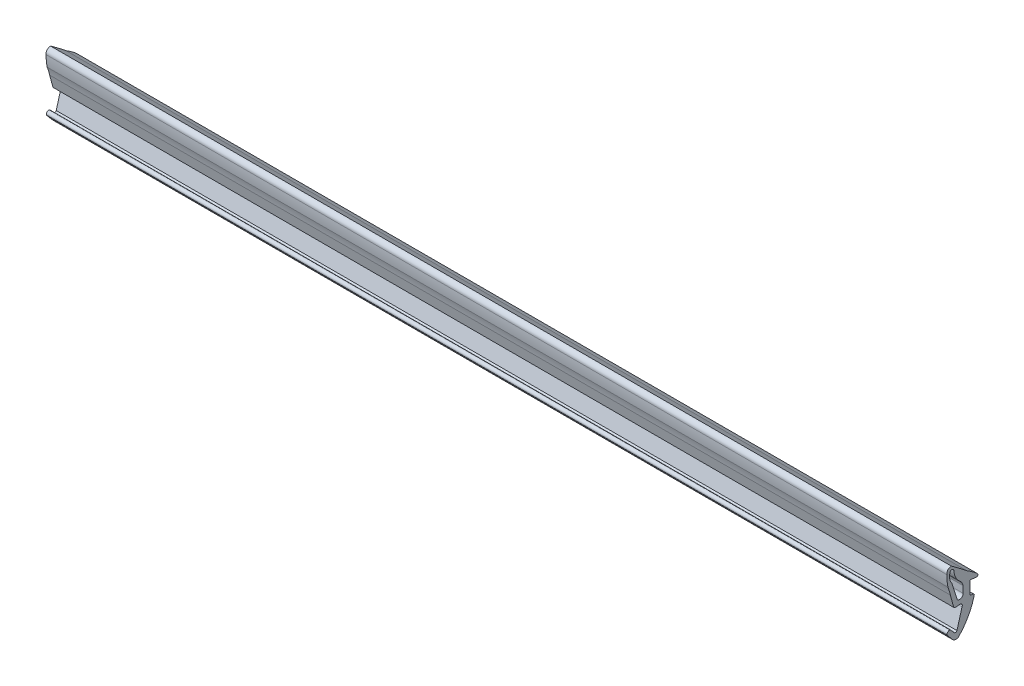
from build123d import *

# Parameters (mm, degrees)
PANEELITIIVISTEET_1_6018_PANEELITIIVISTE_DEPTH = 200


with BuildPart() as part:
    # Sketch14 → Paneelitiivisteet 1.6018 PANEELITIIVISTE (new body)
    with BuildSketch(Plane(origin=(0, 0, 0), x_dir=(0, 0, -1), z_dir=(1, 0, 0))):
        with BuildLine():
            Line((-2.667238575, 2.288061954), (-1.918807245, -0.450346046))
            ThreePointArc((-1.918807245, -0.450346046), (-1.607180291, -0.618579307), (-1.253461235, -0.635801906))
            Line((-1.253461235, -0.635801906), (-0.602053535, -0.520941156))
            ThreePointArc((-0.602053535, -0.520941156), (-0.108171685, -0.722993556), (-0.077919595, -1.255749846))
            Line((-0.077919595, -1.255749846), (-1.204433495, -5.258378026))
            ThreePointArc((-1.204433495, -5.258378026), (-1.515943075, -5.462612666), (-1.860699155, -5.321569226))
            Line((-1.860699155, -5.321569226), (-2.512728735, -4.544510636))
            ThreePointArc((-2.512728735, -4.544510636), (-3.21714476, -4.482882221), (-3.278773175, -5.187298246))
            Line((-3.278773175, -5.187298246), (-2.192928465, -6.481357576))
            ThreePointArc((-2.192928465, -6.481357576), (-1.532995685, -6.832924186), (-0.813734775, -6.628537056))
            ThreePointArc((-0.813734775, -6.628537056), (1.305578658, -3.762647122), (2.619556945, -0.449299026))
            ThreePointArc((2.619556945, -0.449299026), (2.603207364, -0.191936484), (2.393144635, -0.042348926))
            Line((2.393144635, -0.042348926), (1.917622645, 0.041498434))
            ThreePointArc((1.917622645, 0.041498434), (1.739903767, 0.144104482), (1.669717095, 0.336940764))
            Line((1.669717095, 0.336940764), (1.669717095, 2.786623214))
            ThreePointArc((1.669717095, 2.786623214), (1.734599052, 2.934078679), (1.88714824, 2.985862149))
            Line((1.88714824, 2.985862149), (3.14357037, 2.875939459))
            ThreePointArc((3.14357037, 2.875939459), (3.441609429, 3.048012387), (3.38184913, 3.386929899))
            Line((3.38184913, 3.386929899), (3.17289573, 3.595883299))
            ThreePointArc((3.17289573, 3.595883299), (2.122577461, 4.398595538), (1.0214954, 5.130123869))
            ThreePointArc((1.0214954, 5.130123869), (-0.694113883, 6.468317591), (-2.44790276, 7.756068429))
            ThreePointArc((-2.44790276, 7.756068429), (-3.217715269, 7.42000717), (-3.4597788, 6.615672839))
            ThreePointArc((-3.4597788, 6.615672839), (-3.393165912, 5.346377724), (-3.211253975, 4.088420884))
            ThreePointArc((-3.211253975, 4.088420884), (-2.907492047, 3.19783661), (-2.667238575, 2.288061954))
        make_face()
        with BuildLine():
            Line((-2.762908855, 6.650499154), (-2.762672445, 6.632088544))
            ThreePointArc((-2.762672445, 6.632088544), (-2.810859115, 5.460061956), (-2.321250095, 4.394111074))
            Line((-2.321250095, 4.394111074), (-1.090327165, 0.552470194))
            ThreePointArc((-1.090327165, 0.552470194), (-0.261525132, 0.497019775), (0.169717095, 1.206961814))
            Line((0.169717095, 1.206961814), (0.169717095, 2.674100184))
            ThreePointArc((0.169717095, 2.674100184), (-0.139931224, 3.418971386), (-0.687839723, 4.011011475))
            ThreePointArc((-0.687839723, 4.011011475), (-1.573441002, 5.241339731), (-1.891727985, 6.723463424))
            ThreePointArc((-1.891727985, 6.723463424), (-1.959587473, 6.775260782), (-2.010109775, 6.844074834))
            ThreePointArc((-2.010109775, 6.844074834), (-2.462557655, 7.043032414), (-2.762908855, 6.650499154))
        make_face(mode=Mode.SUBTRACT)
    extrude(amount=PANEELITIIVISTEET_1_6018_PANEELITIIVISTE_DEPTH)


solid = part.part
